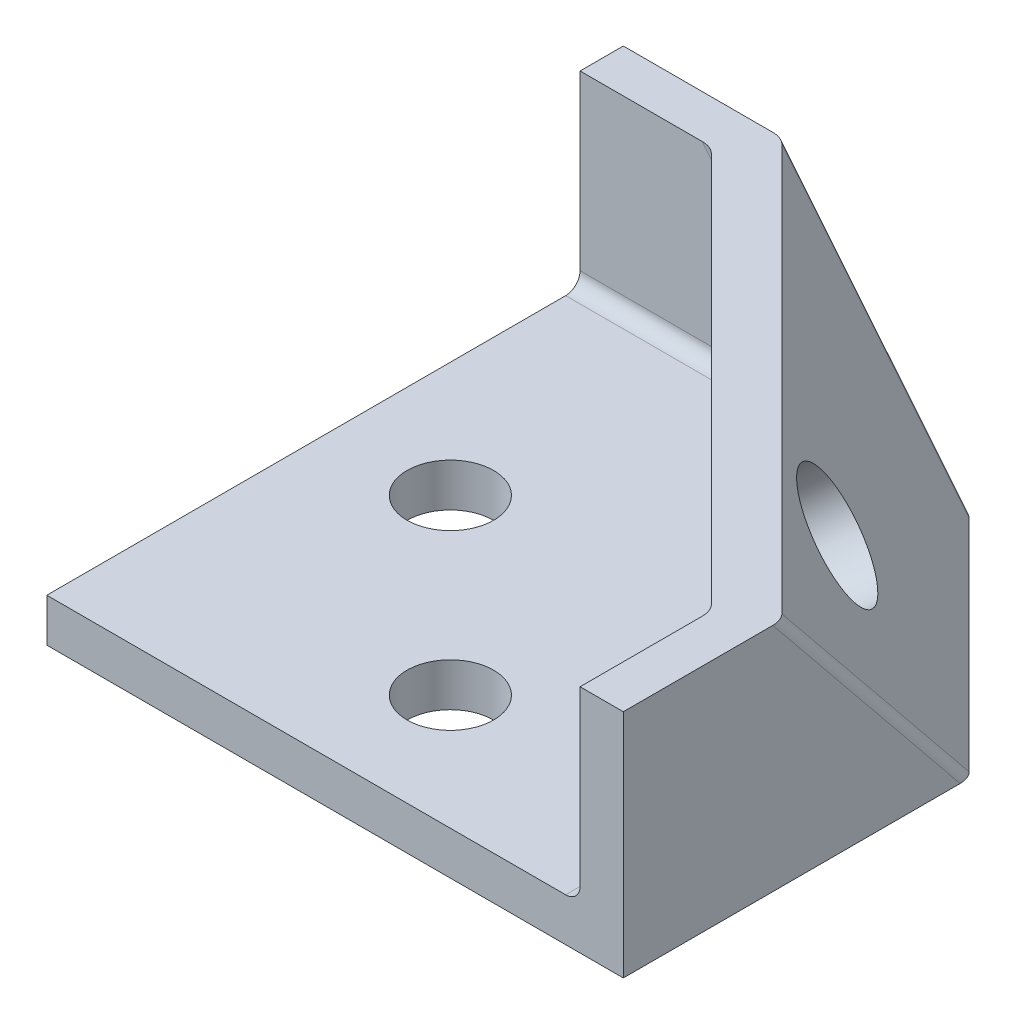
ISO-10303-21;
HEADER;
FILE_DESCRIPTION(('STEP AP214'),'2;1');
FILE_NAME('part.step','',(''),(''),'','','');
FILE_SCHEMA(('AUTOMOTIVE_DESIGN { 1 0 10303 214 1 1 1 1 }'));
ENDSEC;
DATA;
#1=APPLICATION_CONTEXT('core data for automotive mechanical design processes');
#2=APPLICATION_PROTOCOL_DEFINITION('international standard','automotive_design',2000,#1);
#3=PRODUCT_CONTEXT('',#1,'mechanical');
#4=PRODUCT('Part','Part','',(#3));
#5=PRODUCT_RELATED_PRODUCT_CATEGORY('part','',(#4));
#6=PRODUCT_DEFINITION_FORMATION('','',#4);
#7=PRODUCT_DEFINITION_CONTEXT('part definition',#1,'design');
#8=PRODUCT_DEFINITION('design','',#6,#7);
#9=PRODUCT_DEFINITION_SHAPE('','',#8);
#10=(LENGTH_UNIT() NAMED_UNIT(*) SI_UNIT(.MILLI.,.METRE.));
#11=(NAMED_UNIT(*) PLANE_ANGLE_UNIT() SI_UNIT($,.RADIAN.));
#12=(NAMED_UNIT(*) SI_UNIT($,.STERADIAN.) SOLID_ANGLE_UNIT());
#13=UNCERTAINTY_MEASURE_WITH_UNIT(LENGTH_MEASURE(1.E-05),#10,'distance_accuracy_value','');
#14=(GEOMETRIC_REPRESENTATION_CONTEXT(3) GLOBAL_UNCERTAINTY_ASSIGNED_CONTEXT((#13)) GLOBAL_UNIT_ASSIGNED_CONTEXT((#10,
#11,#12)) REPRESENTATION_CONTEXT('',''));
#15=CARTESIAN_POINT('',(0.,0.,0.));
#16=DIRECTION('',(0.,0.,1.));
#17=DIRECTION('',(1.,0.,0.));
#18=AXIS2_PLACEMENT_3D('',#15,#16,#17);
#19=CARTESIAN_POINT('',(-63.5,50.8,-63.5));
#20=DIRECTION('',(1.,0.,0.));
#21=DIRECTION('',(0.,0.,-1.));
#22=AXIS2_PLACEMENT_3D('',#19,#20,#21);
#23=PLANE('',#22);
#24=DIRECTION('',(0.,0.,1.));
#25=VECTOR('',#24,1.);
#26=CARTESIAN_POINT('',(-63.5,9.525,-63.5));
#27=LINE('',#26,#25);
#28=CARTESIAN_POINT('',(-63.5,9.525,-50.8));
#29=VERTEX_POINT('',#28);
#30=CARTESIAN_POINT('',(-63.5,9.525,63.5));
#31=VERTEX_POINT('',#30);
#32=EDGE_CURVE('E318',#29,#31,#27,.T.);
#33=ORIENTED_EDGE('',*,*,#32,.F.);
#34=CARTESIAN_POINT('',(-63.5,12.7,-50.8));
#35=DIRECTION('',(1.,0.,0.));
#36=DIRECTION('',(0.,0.,-1.));
#37=AXIS2_PLACEMENT_3D('',#34,#35,#36);
#38=CIRCLE('',#37,3.175);
#39=CARTESIAN_POINT('',(-63.5,12.7,-53.975));
#40=VERTEX_POINT('',#39);
#41=EDGE_CURVE('E178',#29,#40,#38,.T.);
#42=ORIENTED_EDGE('',*,*,#41,.T.);
#43=DIRECTION('',(0.,-1.,0.));
#44=VECTOR('',#43,1.);
#45=CARTESIAN_POINT('',(-63.5,50.8,-53.975));
#46=LINE('',#45,#44);
#47=CARTESIAN_POINT('',(-63.5,50.8,-53.975));
#48=VERTEX_POINT('',#47);
#49=EDGE_CURVE('E163',#48,#40,#46,.T.);
#50=ORIENTED_EDGE('',*,*,#49,.F.);
#51=DIRECTION('',(0.,0.,1.));
#52=VECTOR('',#51,1.);
#53=CARTESIAN_POINT('',(-63.5,50.8,-63.5));
#54=LINE('',#53,#52);
#55=CARTESIAN_POINT('',(-63.5,50.8,-63.5));
#56=VERTEX_POINT('',#55);
#57=EDGE_CURVE('E176',#56,#48,#54,.T.);
#58=ORIENTED_EDGE('',*,*,#57,.F.);
#59=DIRECTION('',(0.,-1.,0.));
#60=VECTOR('',#59,1.);
#61=CARTESIAN_POINT('',(-63.5,50.8,-63.5));
#62=LINE('',#61,#60);
#63=CARTESIAN_POINT('',(-63.5,0.,-63.5));
#64=VERTEX_POINT('',#63);
#65=EDGE_CURVE('E197',#56,#64,#62,.T.);
#66=ORIENTED_EDGE('',*,*,#65,.T.);
#67=DIRECTION('',(0.,0.,1.));
#68=VECTOR('',#67,1.);
#69=CARTESIAN_POINT('',(-63.5,0.,-63.5));
#70=LINE('',#69,#68);
#71=CARTESIAN_POINT('',(-63.5,0.,63.5));
#72=VERTEX_POINT('',#71);
#73=EDGE_CURVE('E325',#64,#72,#70,.T.);
#74=ORIENTED_EDGE('',*,*,#73,.T.);
#75=DIRECTION('',(0.,-1.,0.));
#76=VECTOR('',#75,1.);
#77=CARTESIAN_POINT('',(-63.5,50.8,63.5));
#78=LINE('',#77,#76);
#79=EDGE_CURVE('E202',#31,#72,#78,.T.);
#80=ORIENTED_EDGE('',*,*,#79,.F.);
#81=EDGE_LOOP('',(#33,#42,#50,#58,#66,#74,#80));
#82=FACE_BOUND('',#81,.T.);
#83=ADVANCED_FACE('F52',(#82),#23,.F.);
#84=CARTESIAN_POINT('',(-63.5,50.8,63.5));
#85=DIRECTION('',(0.,0.,-1.));
#86=DIRECTION('',(-1.,0.,0.));
#87=AXIS2_PLACEMENT_3D('',#84,#85,#86);
#88=PLANE('',#87);
#89=DIRECTION('',(1.,0.,0.));
#90=VECTOR('',#89,1.);
#91=CARTESIAN_POINT('',(-63.5,9.525,63.5));
#92=LINE('',#91,#90);
#93=CARTESIAN_POINT('',(50.8,9.525,63.5));
#94=VERTEX_POINT('',#93);
#95=EDGE_CURVE('E264',#31,#94,#92,.T.);
#96=ORIENTED_EDGE('',*,*,#95,.F.);
#97=ORIENTED_EDGE('',*,*,#79,.T.);
#98=DIRECTION('',(1.,0.,0.));
#99=VECTOR('',#98,1.);
#100=CARTESIAN_POINT('',(-63.5,0.,63.5));
#101=LINE('',#100,#99);
#102=CARTESIAN_POINT('',(63.5,0.,63.5));
#103=VERTEX_POINT('',#102);
#104=EDGE_CURVE('E328',#72,#103,#101,.T.);
#105=ORIENTED_EDGE('',*,*,#104,.T.);
#106=DIRECTION('',(0.,-1.,0.));
#107=VECTOR('',#106,1.);
#108=CARTESIAN_POINT('',(63.5,50.8,63.5));
#109=LINE('',#108,#107);
#110=CARTESIAN_POINT('',(63.5,50.8,63.5));
#111=VERTEX_POINT('',#110);
#112=EDGE_CURVE('E199',#111,#103,#109,.T.);
#113=ORIENTED_EDGE('',*,*,#112,.F.);
#114=DIRECTION('',(1.,0.,0.));
#115=VECTOR('',#114,1.);
#116=CARTESIAN_POINT('',(-63.5,50.8,63.5));
#117=LINE('',#116,#115);
#118=CARTESIAN_POINT('',(53.975,50.8,63.5));
#119=VERTEX_POINT('',#118);
#120=EDGE_CURVE('E185',#119,#111,#117,.T.);
#121=ORIENTED_EDGE('',*,*,#120,.F.);
#122=DIRECTION('',(0.,-1.,0.));
#123=VECTOR('',#122,1.);
#124=CARTESIAN_POINT('',(53.975,50.8,63.5));
#125=LINE('',#124,#123);
#126=CARTESIAN_POINT('',(53.975,12.7,63.5));
#127=VERTEX_POINT('',#126);
#128=EDGE_CURVE('E179',#119,#127,#125,.T.);
#129=ORIENTED_EDGE('',*,*,#128,.T.);
#130=CARTESIAN_POINT('',(50.8,12.7,63.5));
#131=DIRECTION('',(0.,0.,-1.));
#132=DIRECTION('',(-1.,0.,0.));
#133=AXIS2_PLACEMENT_3D('',#130,#131,#132);
#134=CIRCLE('',#133,3.175);
#135=EDGE_CURVE('E217',#127,#94,#134,.T.);
#136=ORIENTED_EDGE('',*,*,#135,.T.);
#137=EDGE_LOOP('',(#96,#97,#105,#113,#121,#129,#136));
#138=FACE_BOUND('',#137,.T.);
#139=ADVANCED_FACE('F351',(#138),#88,.F.);
#140=CARTESIAN_POINT('',(63.5,50.8,-63.5));
#141=DIRECTION('',(-1.,0.,0.));
#142=DIRECTION('',(0.,0.,1.));
#143=AXIS2_PLACEMENT_3D('',#140,#141,#142);
#144=PLANE('',#143);
#145=DIRECTION('',(0.,0.,-1.));
#146=VECTOR('',#145,1.);
#147=CARTESIAN_POINT('',(63.5,0.,-63.5));
#148=LINE('',#147,#146);
#149=CARTESIAN_POINT('',(63.5,0.,-10.696579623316));
#150=VERTEX_POINT('',#149);
#151=EDGE_CURVE('E190',#103,#150,#148,.T.);
#152=ORIENTED_EDGE('',*,*,#151,.T.);
#153=DIRECTION('',(0.,-0.776114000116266,-0.630592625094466));
#154=VECTOR('',#153,1.);
#155=CARTESIAN_POINT('',(63.5,49.8195024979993,29.7817661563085));
#156=LINE('',#155,#154);
#157=CARTESIAN_POINT('',(63.5,50.8,30.578420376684));
#158=VERTEX_POINT('',#157);
#159=EDGE_CURVE('E249',#150,#158,#156,.F.);
#160=ORIENTED_EDGE('',*,*,#159,.T.);
#161=DIRECTION('',(0.,0.,-1.));
#162=VECTOR('',#161,1.);
#163=CARTESIAN_POINT('',(63.5,50.8,-63.5));
#164=LINE('',#163,#162);
#165=EDGE_CURVE('E188',#111,#158,#164,.T.);
#166=ORIENTED_EDGE('',*,*,#165,.F.);
#167=ORIENTED_EDGE('',*,*,#112,.T.);
#168=EDGE_LOOP('',(#152,#160,#166,#167));
#169=FACE_BOUND('',#168,.T.);
#170=ADVANCED_FACE('F331',(#169),#144,.F.);
#171=CARTESIAN_POINT('',(-63.5,50.8,-63.5));
#172=DIRECTION('',(0.,0.,1.));
#173=DIRECTION('',(1.,0.,0.));
#174=AXIS2_PLACEMENT_3D('',#171,#172,#173);
#175=PLANE('',#174);
#176=DIRECTION('',(-1.,0.,0.));
#177=VECTOR('',#176,1.);
#178=CARTESIAN_POINT('',(-63.5,50.8,-63.5));
#179=LINE('',#178,#177);
#180=CARTESIAN_POINT('',(-30.5784203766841,50.8,-63.5));
#181=VERTEX_POINT('',#180);
#182=EDGE_CURVE('E183',#181,#56,#179,.T.);
#183=ORIENTED_EDGE('',*,*,#182,.F.);
#184=DIRECTION('',(-0.630592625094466,0.776114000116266,0.));
#185=VECTOR('',#184,1.);
#186=CARTESIAN_POINT('',(11.4932338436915,-0.980497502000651,-63.5));
#187=LINE('',#186,#185);
#188=CARTESIAN_POINT('',(10.696579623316,0.,-63.5));
#189=VERTEX_POINT('',#188);
#190=EDGE_CURVE('E74',#181,#189,#187,.F.);
#191=ORIENTED_EDGE('',*,*,#190,.T.);
#192=DIRECTION('',(-1.,0.,0.));
#193=VECTOR('',#192,1.);
#194=CARTESIAN_POINT('',(-63.5,0.,-63.5));
#195=LINE('',#194,#193);
#196=EDGE_CURVE('E186',#189,#64,#195,.T.);
#197=ORIENTED_EDGE('',*,*,#196,.T.);
#198=ORIENTED_EDGE('',*,*,#65,.F.);
#199=EDGE_LOOP('',(#183,#191,#197,#198));
#200=FACE_BOUND('',#199,.T.);
#201=ADVANCED_FACE('F346',(#200),#175,.F.);
#202=CARTESIAN_POINT('',(-63.5,50.8,63.5));
#203=DIRECTION('',(0.,1.,0.));
#204=DIRECTION('',(0.,0.,1.));
#205=AXIS2_PLACEMENT_3D('',#202,#203,#204);
#206=PLANE('',#205);
#207=DIRECTION('',(-0.707106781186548,0.,-0.707106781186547));
#208=VECTOR('',#207,1.);
#209=CARTESIAN_POINT('',(17.4625,50.8,-17.4625));
#210=LINE('',#209,#208);
#211=CARTESIAN_POINT('',(62.2716602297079,50.8,27.346660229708));
#212=VERTEX_POINT('',#211);
#213=CARTESIAN_POINT('',(-27.346660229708,50.8,-62.2716602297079));
#214=VERTEX_POINT('',#213);
#215=EDGE_CURVE('E323',#212,#214,#210,.T.);
#216=ORIENTED_EDGE('',*,*,#215,.T.);
#217=CARTESIAN_POINT('',(-30.5784203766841,50.8,-60.325));
#218=DIRECTION('',(0.,1.,0.));
#219=DIRECTION('',(1.,0.,0.));
#220=AXIS2_PLACEMENT_3D('',#217,#218,#219);
#221=ELLIPSE('',#220,4.09089386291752,3.175);
#222=EDGE_CURVE('E243',#214,#181,#221,.T.);
#223=ORIENTED_EDGE('',*,*,#222,.T.);
#224=ORIENTED_EDGE('',*,*,#182,.T.);
#225=ORIENTED_EDGE('',*,*,#57,.T.);
#226=DIRECTION('',(-1.,0.,0.));
#227=VECTOR('',#226,1.);
#228=CARTESIAN_POINT('',(-63.5,50.8,-53.975));
#229=LINE('',#228,#227);
#230=CARTESIAN_POINT('',(-36.5886815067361,50.8,-53.975));
#231=VERTEX_POINT('',#230);
#232=EDGE_CURVE('E159',#231,#48,#229,.T.);
#233=ORIENTED_EDGE('',*,*,#232,.F.);
#234=CARTESIAN_POINT('',(-36.5886815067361,50.8,-50.8));
#235=DIRECTION('',(0.,1.,0.));
#236=DIRECTION('',(-1.,0.,0.));
#237=AXIS2_PLACEMENT_3D('',#234,#235,#236);
#238=ELLIPSE('',#237,4.09089386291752,3.175);
#239=CARTESIAN_POINT('',(-33.35692135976,50.8,-52.7466602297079));
#240=VERTEX_POINT('',#239);
#241=EDGE_CURVE('E36',#231,#240,#238,.F.);
#242=ORIENTED_EDGE('',*,*,#241,.T.);
#243=DIRECTION('',(-0.707106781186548,0.,-0.707106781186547));
#244=VECTOR('',#243,1.);
#245=CARTESIAN_POINT('',(9.69486943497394,50.8,-9.69486943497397));
#246=LINE('',#245,#244);
#247=CARTESIAN_POINT('',(52.7466602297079,50.8,33.35692135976));
#248=VERTEX_POINT('',#247);
#249=EDGE_CURVE('E256',#248,#240,#246,.T.);
#250=ORIENTED_EDGE('',*,*,#249,.F.);
#251=CARTESIAN_POINT('',(50.8,50.8,36.5886815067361));
#252=DIRECTION('',(0.,1.,0.));
#253=DIRECTION('',(0.,0.,-1.));
#254=AXIS2_PLACEMENT_3D('',#251,#252,#253);
#255=ELLIPSE('',#254,4.09089386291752,3.175);
#256=CARTESIAN_POINT('',(53.975,50.8,36.5886815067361));
#257=VERTEX_POINT('',#256);
#258=EDGE_CURVE('E59',#248,#257,#255,.F.);
#259=ORIENTED_EDGE('',*,*,#258,.T.);
#260=DIRECTION('',(0.,0.,-1.));
#261=VECTOR('',#260,1.);
#262=CARTESIAN_POINT('',(53.975,50.8,-63.5));
#263=LINE('',#262,#261);
#264=EDGE_CURVE('E170',#119,#257,#263,.T.);
#265=ORIENTED_EDGE('',*,*,#264,.F.);
#266=ORIENTED_EDGE('',*,*,#120,.T.);
#267=ORIENTED_EDGE('',*,*,#165,.T.);
#268=CARTESIAN_POINT('',(60.325,50.8,30.578420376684));
#269=DIRECTION('',(0.,1.,0.));
#270=DIRECTION('',(0.,0.,1.));
#271=AXIS2_PLACEMENT_3D('',#268,#269,#270);
#272=ELLIPSE('',#271,4.09089386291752,3.175);
#273=EDGE_CURVE('E241',#158,#212,#272,.T.);
#274=ORIENTED_EDGE('',*,*,#273,.T.);
#275=EDGE_LOOP('',(#216,#223,#224,#225,#233,#242,#250,#259,#265,#266,#267,#274));
#276=FACE_BOUND('',#275,.T.);
#277=ADVANCED_FACE('F182',(#276),#206,.T.);
#278=CARTESIAN_POINT('',(-63.5,0.,63.5));
#279=DIRECTION('',(0.,1.,0.));
#280=DIRECTION('',(0.,0.,1.));
#281=AXIS2_PLACEMENT_3D('',#278,#279,#280);
#282=PLANE('',#281);
#283=CARTESIAN_POINT('',(0.,0.,38.1));
#284=DIRECTION('',(0.,1.,0.));
#285=DIRECTION('',(0.,0.,1.));
#286=AXIS2_PLACEMENT_3D('',#283,#284,#285);
#287=CIRCLE('',#286,9.525);
#288=CARTESIAN_POINT('',(0.,0.,47.625));
#289=VERTEX_POINT('',#288);
#290=EDGE_CURVE('E303',#289,#289,#287,.T.);
#291=ORIENTED_EDGE('',*,*,#290,.T.);
#292=EDGE_LOOP('',(#291));
#293=FACE_BOUND('',#292,.T.);
#294=CARTESIAN_POINT('',(-38.1,0.,0.));
#295=DIRECTION('',(0.,1.,0.));
#296=DIRECTION('',(0.,0.,1.));
#297=AXIS2_PLACEMENT_3D('',#294,#295,#296);
#298=CIRCLE('',#297,9.525);
#299=CARTESIAN_POINT('',(-38.1,0.,9.525));
#300=VERTEX_POINT('',#299);
#301=EDGE_CURVE('E309',#300,#300,#298,.T.);
#302=ORIENTED_EDGE('',*,*,#301,.T.);
#303=EDGE_LOOP('',(#302));
#304=FACE_BOUND('',#303,.T.);
#305=ORIENTED_EDGE('',*,*,#196,.F.);
#306=CARTESIAN_POINT('',(10.696579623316,0.,-60.325));
#307=DIRECTION('',(0.,1.,0.));
#308=DIRECTION('',(1.,0.,0.));
#309=AXIS2_PLACEMENT_3D('',#306,#307,#308);
#310=ELLIPSE('',#309,4.09089386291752,3.175);
#311=CARTESIAN_POINT('',(13.928339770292,0.,-62.2716602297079));
#312=VERTEX_POINT('',#311);
#313=EDGE_CURVE('E247',#189,#312,#310,.F.);
#314=ORIENTED_EDGE('',*,*,#313,.T.);
#315=DIRECTION('',(-0.707106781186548,0.,-0.707106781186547));
#316=VECTOR('',#315,1.);
#317=CARTESIAN_POINT('',(38.1,0.,-38.1));
#318=LINE('',#317,#316);
#319=CARTESIAN_POINT('',(62.2716602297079,0.,-13.9283397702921));
#320=VERTEX_POINT('',#319);
#321=EDGE_CURVE('E204',#320,#312,#318,.T.);
#322=ORIENTED_EDGE('',*,*,#321,.F.);
#323=CARTESIAN_POINT('',(60.325,0.,-10.696579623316));
#324=DIRECTION('',(0.,1.,0.));
#325=DIRECTION('',(0.,0.,1.));
#326=AXIS2_PLACEMENT_3D('',#323,#324,#325);
#327=ELLIPSE('',#326,4.09089386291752,3.175);
#328=EDGE_CURVE('E66',#320,#150,#327,.F.);
#329=ORIENTED_EDGE('',*,*,#328,.T.);
#330=ORIENTED_EDGE('',*,*,#151,.F.);
#331=ORIENTED_EDGE('',*,*,#104,.F.);
#332=ORIENTED_EDGE('',*,*,#73,.F.);
#333=EDGE_LOOP('',(#305,#314,#322,#329,#330,#331,#332));
#334=FACE_BOUND('',#333,.T.);
#335=ADVANCED_FACE('F349',(#293,#304,#334),#282,.F.);
#336=CARTESIAN_POINT('',(28.6449339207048,23.2740088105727,-28.6449339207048));
#337=DIRECTION('',(0.613121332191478,0.498161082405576,-0.613121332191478));
#338=DIRECTION('',(-0.707106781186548,0.,-0.707106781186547));
#339=AXIS2_PLACEMENT_3D('',#336,#337,#338);
#340=PLANE('',#339);
#341=CARTESIAN_POINT('',(38.4178570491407,35.7889128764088,-8.70365123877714));
#342=DIRECTION('',(0.613121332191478,0.498161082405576,-0.613121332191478));
#343=DIRECTION('',(-0.707106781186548,0.,-0.707106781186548));
#344=AXIS2_PLACEMENT_3D('',#341,#342,#343);
#345=CIRCLE('',#344,12.7);
#346=CARTESIAN_POINT('',(29.4376009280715,35.7889128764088,-17.6839073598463));
#347=VERTEX_POINT('',#346);
#348=EDGE_CURVE('E312',#347,#347,#345,.T.);
#349=ORIENTED_EDGE('',*,*,#348,.F.);
#350=EDGE_LOOP('',(#349));
#351=FACE_BOUND('',#350,.T.);
#352=ORIENTED_EDGE('',*,*,#321,.T.);
#353=DIRECTION('',(-0.630592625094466,0.776114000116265,0.));
#354=VECTOR('',#353,1.);
#355=CARTESIAN_POINT('',(-27.8351059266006,51.401163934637,-62.2716602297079));
#356=LINE('',#355,#354);
#357=EDGE_CURVE('E238',#312,#214,#356,.T.);
#358=ORIENTED_EDGE('',*,*,#357,.T.);
#359=ORIENTED_EDGE('',*,*,#215,.F.);
#360=DIRECTION('',(0.,-0.776114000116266,-0.630592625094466));
#361=VECTOR('',#360,1.);
#362=CARTESIAN_POINT('',(62.2716602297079,0.601163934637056,-13.4398940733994));
#363=LINE('',#362,#361);
#364=EDGE_CURVE('E235',#212,#320,#363,.T.);
#365=ORIENTED_EDGE('',*,*,#364,.T.);
#366=EDGE_LOOP('',(#352,#358,#359,#365));
#367=FACE_BOUND('',#366,.T.);
#368=ADVANCED_FACE('F341',(#351,#367),#340,.T.);
#369=CARTESIAN_POINT('',(53.975,50.8,-63.5));
#370=DIRECTION('',(-1.,0.,0.));
#371=DIRECTION('',(0.,0.,1.));
#372=AXIS2_PLACEMENT_3D('',#369,#370,#371);
#373=PLANE('',#372);
#374=ORIENTED_EDGE('',*,*,#264,.T.);
#375=DIRECTION('',(0.,-0.776114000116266,-0.630592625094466));
#376=VECTOR('',#375,1.);
#377=CARTESIAN_POINT('',(53.975,1.81542175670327,-3.21128831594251));
#378=LINE('',#377,#376);
#379=CARTESIAN_POINT('',(53.975,12.7,5.63243150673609));
#380=VERTEX_POINT('',#379);
#381=EDGE_CURVE('E219',#257,#380,#378,.T.);
#382=ORIENTED_EDGE('',*,*,#381,.T.);
#383=DIRECTION('',(0.,0.,-1.));
#384=VECTOR('',#383,1.);
#385=CARTESIAN_POINT('',(53.975,12.7,63.5));
#386=LINE('',#385,#384);
#387=EDGE_CURVE('E214',#380,#127,#386,.F.);
#388=ORIENTED_EDGE('',*,*,#387,.T.);
#389=ORIENTED_EDGE('',*,*,#128,.F.);
#390=EDGE_LOOP('',(#374,#382,#388,#389));
#391=FACE_BOUND('',#390,.T.);
#392=ADVANCED_FACE('F261',(#391),#373,.T.);
#393=CARTESIAN_POINT('',(-63.5,50.8,-53.975));
#394=DIRECTION('',(0.,0.,1.));
#395=DIRECTION('',(1.,0.,0.));
#396=AXIS2_PLACEMENT_3D('',#393,#394,#395);
#397=PLANE('',#396);
#398=DIRECTION('',(-1.,0.,0.));
#399=VECTOR('',#398,1.);
#400=CARTESIAN_POINT('',(-1.04932363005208,12.7,-53.975));
#401=LINE('',#400,#399);
#402=CARTESIAN_POINT('',(-5.6324315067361,12.7,-53.975));
#403=VERTEX_POINT('',#402);
#404=EDGE_CURVE('E212',#40,#403,#401,.F.);
#405=ORIENTED_EDGE('',*,*,#404,.T.);
#406=DIRECTION('',(-0.630592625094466,0.776114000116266,0.));
#407=VECTOR('',#406,1.);
#408=CARTESIAN_POINT('',(-47.2898881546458,63.9707158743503,-53.975));
#409=LINE('',#408,#407);
#410=EDGE_CURVE('E166',#403,#231,#409,.T.);
#411=ORIENTED_EDGE('',*,*,#410,.T.);
#412=ORIENTED_EDGE('',*,*,#232,.T.);
#413=ORIENTED_EDGE('',*,*,#49,.T.);
#414=EDGE_LOOP('',(#405,#411,#412,#413));
#415=FACE_BOUND('',#414,.T.);
#416=ADVANCED_FACE('F162',(#415),#397,.T.);
#417=CARTESIAN_POINT('',(-63.5,9.525,63.5));
#418=DIRECTION('',(0.,1.,0.));
#419=DIRECTION('',(0.,0.,1.));
#420=AXIS2_PLACEMENT_3D('',#417,#418,#419);
#421=PLANE('',#420);
#422=CARTESIAN_POINT('',(0.,9.525,38.1));
#423=DIRECTION('',(0.,1.,0.));
#424=DIRECTION('',(0.,0.,1.));
#425=AXIS2_PLACEMENT_3D('',#422,#423,#424);
#426=CIRCLE('',#425,9.525);
#427=CARTESIAN_POINT('',(0.,9.525,47.625));
#428=VERTEX_POINT('',#427);
#429=EDGE_CURVE('E297',#428,#428,#426,.T.);
#430=ORIENTED_EDGE('',*,*,#429,.F.);
#431=EDGE_LOOP('',(#430));
#432=FACE_BOUND('',#431,.T.);
#433=CARTESIAN_POINT('',(-38.1,9.525,0.));
#434=DIRECTION('',(0.,1.,0.));
#435=DIRECTION('',(0.,0.,1.));
#436=AXIS2_PLACEMENT_3D('',#433,#434,#435);
#437=CIRCLE('',#436,9.525);
#438=CARTESIAN_POINT('',(-38.1,9.525,9.525));
#439=VERTEX_POINT('',#438);
#440=EDGE_CURVE('E306',#439,#439,#437,.T.);
#441=ORIENTED_EDGE('',*,*,#440,.F.);
#442=EDGE_LOOP('',(#441));
#443=FACE_BOUND('',#442,.T.);
#444=DIRECTION('',(0.,0.,-1.));
#445=VECTOR('',#444,1.);
#446=CARTESIAN_POINT('',(50.8,9.525,1.04932363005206));
#447=LINE('',#446,#445);
#448=CARTESIAN_POINT('',(50.8,9.525,5.63243150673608));
#449=VERTEX_POINT('',#448);
#450=EDGE_CURVE('E207',#94,#449,#447,.T.);
#451=ORIENTED_EDGE('',*,*,#450,.T.);
#452=DIRECTION('',(-0.707106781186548,0.,-0.707106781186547));
#453=VECTOR('',#452,1.);
#454=CARTESIAN_POINT('',(22.5837842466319,9.525,-22.583784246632));
#455=LINE('',#454,#453);
#456=CARTESIAN_POINT('',(-5.6324315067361,9.525,-50.8));
#457=VERTEX_POINT('',#456);
#458=EDGE_CURVE('E230',#449,#457,#455,.T.);
#459=ORIENTED_EDGE('',*,*,#458,.T.);
#460=DIRECTION('',(-1.,0.,0.));
#461=VECTOR('',#460,1.);
#462=CARTESIAN_POINT('',(-63.5,9.525,-50.8));
#463=LINE('',#462,#461);
#464=EDGE_CURVE('E210',#457,#29,#463,.T.);
#465=ORIENTED_EDGE('',*,*,#464,.T.);
#466=ORIENTED_EDGE('',*,*,#32,.T.);
#467=ORIENTED_EDGE('',*,*,#95,.T.);
#468=EDGE_LOOP('',(#451,#459,#465,#466,#467));
#469=FACE_BOUND('',#468,.T.);
#470=ADVANCED_FACE('F283',(#432,#443,#469),#421,.T.);
#471=CARTESIAN_POINT('',(22.804953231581,18.5290245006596,-22.804953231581));
#472=DIRECTION('',(0.613121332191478,0.498161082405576,-0.613121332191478));
#473=DIRECTION('',(-0.707106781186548,0.,-0.707106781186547));
#474=AXIS2_PLACEMENT_3D('',#471,#472,#473);
#475=PLANE('',#474);
#476=CARTESIAN_POINT('',(32.5778763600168,31.0439285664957,-2.86367054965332));
#477=DIRECTION('',(0.613121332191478,0.498161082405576,-0.613121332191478));
#478=DIRECTION('',(-0.707106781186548,0.,-0.707106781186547));
#479=AXIS2_PLACEMENT_3D('',#476,#477,#478);
#480=CIRCLE('',#479,12.7);
#481=CARTESIAN_POINT('',(23.5976202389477,31.0439285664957,-11.8439266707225));
#482=VERTEX_POINT('',#481);
#483=EDGE_CURVE('E315',#482,#482,#480,.F.);
#484=ORIENTED_EDGE('',*,*,#483,.F.);
#485=EDGE_LOOP('',(#484));
#486=FACE_BOUND('',#485,.T.);
#487=DIRECTION('',(-0.707106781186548,0.,-0.707106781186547));
#488=VECTOR('',#487,1.);
#489=CARTESIAN_POINT('',(24.5304444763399,14.2816614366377,-24.5304444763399));
#490=LINE('',#489,#488);
#491=CARTESIAN_POINT('',(-3.68577127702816,14.2816614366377,-52.7466602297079));
#492=VERTEX_POINT('',#491);
#493=CARTESIAN_POINT('',(52.7466602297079,14.2816614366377,3.68577127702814));
#494=VERTEX_POINT('',#493);
#495=EDGE_CURVE('E224',#492,#494,#490,.F.);
#496=ORIENTED_EDGE('',*,*,#495,.T.);
#497=DIRECTION('',(0.,-0.776114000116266,-0.630592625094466));
#498=VECTOR('',#497,1.);
#499=CARTESIAN_POINT('',(52.7466602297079,3.87520084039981,-4.76947795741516));
#500=LINE('',#499,#498);
#501=EDGE_CURVE('E226',#494,#248,#500,.F.);
#502=ORIENTED_EDGE('',*,*,#501,.T.);
#503=ORIENTED_EDGE('',*,*,#249,.T.);
#504=DIRECTION('',(-0.630592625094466,0.776114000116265,0.));
#505=VECTOR('',#504,1.);
#506=CARTESIAN_POINT('',(4.76947795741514,3.8752008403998,-52.7466602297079));
#507=LINE('',#506,#505);
#508=EDGE_CURVE('E222',#240,#492,#507,.F.);
#509=ORIENTED_EDGE('',*,*,#508,.T.);
#510=EDGE_LOOP('',(#496,#502,#503,#509));
#511=FACE_BOUND('',#510,.T.);
#512=ADVANCED_FACE('F387',(#486,#511),#475,.F.);
#513=CARTESIAN_POINT('',(-37.9696906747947,-26.2759696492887,67.6838964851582));
#514=DIRECTION('',(0.613121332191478,0.498161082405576,-0.613121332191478));
#515=DIRECTION('',(-0.707106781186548,0.,-0.707106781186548));
#516=AXIS2_PLACEMENT_3D('',#513,#514,#515);
#517=CYLINDRICAL_SURFACE('',#516,12.7);
#518=ORIENTED_EDGE('',*,*,#348,.T.);
#519=EDGE_LOOP('',(#518));
#520=FACE_BOUND('',#519,.T.);
#521=ORIENTED_EDGE('',*,*,#483,.T.);
#522=EDGE_LOOP('',(#521));
#523=FACE_BOUND('',#522,.T.);
#524=ADVANCED_FACE('F390',(#520,#523),#517,.F.);
#525=CARTESIAN_POINT('',(-38.1,0.,0.));
#526=DIRECTION('',(0.,1.,0.));
#527=DIRECTION('',(0.,0.,1.));
#528=AXIS2_PLACEMENT_3D('',#525,#526,#527);
#529=CYLINDRICAL_SURFACE('',#528,9.525);
#530=CARTESIAN_POINT('',(-38.1,0.,9.525));
#531=CARTESIAN_POINT('',(-38.1,0.0992187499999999,9.525));
#532=CARTESIAN_POINT('',(-38.1,0.1984375,9.525));
#533=CARTESIAN_POINT('',(-38.1,0.396875,9.525));
#534=CARTESIAN_POINT('',(-38.1,0.49609375,9.525));
#535=CARTESIAN_POINT('',(-38.1,0.69453125,9.525));
#536=CARTESIAN_POINT('',(-38.1,0.79375,9.525));
#537=CARTESIAN_POINT('',(-38.1,0.9921875,9.525));
#538=CARTESIAN_POINT('',(-38.1,1.09140625,9.525));
#539=CARTESIAN_POINT('',(-38.1,1.28984375,9.525));
#540=CARTESIAN_POINT('',(-38.1,1.3890625,9.525));
#541=CARTESIAN_POINT('',(-38.1,1.5875,9.525));
#542=CARTESIAN_POINT('',(-38.1,1.68671875,9.525));
#543=CARTESIAN_POINT('',(-38.1,1.88515625,9.525));
#544=CARTESIAN_POINT('',(-38.1,1.984375,9.525));
#545=CARTESIAN_POINT('',(-38.1,2.1828125,9.525));
#546=CARTESIAN_POINT('',(-38.1,2.28203125,9.525));
#547=CARTESIAN_POINT('',(-38.1,2.48046875,9.525));
#548=CARTESIAN_POINT('',(-38.1,2.5796875,9.525));
#549=CARTESIAN_POINT('',(-38.1,2.778125,9.525));
#550=CARTESIAN_POINT('',(-38.1,2.87734375,9.525));
#551=CARTESIAN_POINT('',(-38.1,3.07578125,9.525));
#552=CARTESIAN_POINT('',(-38.1,3.175,9.525));
#553=CARTESIAN_POINT('',(-38.1,3.3734375,9.525));
#554=CARTESIAN_POINT('',(-38.1,3.47265625,9.525));
#555=CARTESIAN_POINT('',(-38.1,3.67109375,9.525));
#556=CARTESIAN_POINT('',(-38.1,3.7703125,9.525));
#557=CARTESIAN_POINT('',(-38.1,3.96875,9.525));
#558=CARTESIAN_POINT('',(-38.1,4.06796875,9.525));
#559=CARTESIAN_POINT('',(-38.1,4.26640625,9.525));
#560=CARTESIAN_POINT('',(-38.1,4.365625,9.525));
#561=CARTESIAN_POINT('',(-38.1,4.5640625,9.525));
#562=CARTESIAN_POINT('',(-38.1,4.66328125,9.525));
#563=CARTESIAN_POINT('',(-38.1,4.86171875,9.525));
#564=CARTESIAN_POINT('',(-38.1,4.9609375,9.525));
#565=CARTESIAN_POINT('',(-38.1,5.159375,9.525));
#566=CARTESIAN_POINT('',(-38.1,5.25859375,9.525));
#567=CARTESIAN_POINT('',(-38.1,5.45703125,9.525));
#568=CARTESIAN_POINT('',(-38.1,5.55625,9.525));
#569=CARTESIAN_POINT('',(-38.1,5.7546875,9.525));
#570=CARTESIAN_POINT('',(-38.1,5.85390625,9.525));
#571=CARTESIAN_POINT('',(-38.1,6.05234375,9.525));
#572=CARTESIAN_POINT('',(-38.1,6.1515625,9.525));
#573=CARTESIAN_POINT('',(-38.1,6.35,9.525));
#574=CARTESIAN_POINT('',(-38.1,6.44921875,9.525));
#575=CARTESIAN_POINT('',(-38.1,6.64765625,9.525));
#576=CARTESIAN_POINT('',(-38.1,6.746875,9.525));
#577=CARTESIAN_POINT('',(-38.1,6.9453125,9.525));
#578=CARTESIAN_POINT('',(-38.1,7.04453125,9.525));
#579=CARTESIAN_POINT('',(-38.1,7.24296875,9.525));
#580=CARTESIAN_POINT('',(-38.1,7.3421875,9.525));
#581=CARTESIAN_POINT('',(-38.1,7.540625,9.525));
#582=CARTESIAN_POINT('',(-38.1,7.63984375,9.525));
#583=CARTESIAN_POINT('',(-38.1,7.83828125,9.525));
#584=CARTESIAN_POINT('',(-38.1,7.9375,9.525));
#585=CARTESIAN_POINT('',(-38.1,8.1359375,9.525));
#586=CARTESIAN_POINT('',(-38.1,8.23515625,9.525));
#587=CARTESIAN_POINT('',(-38.1,8.43359375,9.525));
#588=CARTESIAN_POINT('',(-38.1,8.5328125,9.525));
#589=CARTESIAN_POINT('',(-38.1,8.73125,9.525));
#590=CARTESIAN_POINT('',(-38.1,8.83046875,9.525));
#591=CARTESIAN_POINT('',(-38.1,9.02890625,9.525));
#592=CARTESIAN_POINT('',(-38.1,9.128125,9.525));
#593=CARTESIAN_POINT('',(-38.1,9.3265625,9.525));
#594=CARTESIAN_POINT('',(-38.1,9.42578125,9.525));
#595=CARTESIAN_POINT('',(-38.1,9.525,9.525));
#596=B_SPLINE_CURVE_WITH_KNOTS('',3,(#530,#531,#532,#533,#534,#535,#536,#537,#538,#539,#540,
#541,#542,#543,#544,#545,#546,#547,#548,#549,#550,#551,#552,#553,#554,#555,#556,#557,#558,#559,
#560,#561,#562,#563,#564,#565,#566,#567,#568,#569,#570,#571,#572,#573,#574,#575,#576,#577,#578,
#579,#580,#581,#582,#583,#584,#585,#586,#587,#588,#589,#590,#591,#592,#593,#594,#595),
.UNSPECIFIED.,.F.,.F.,(4,2,2,2,2,2,2,2,2,2,2,2,2,2,2,2,2,2,2,2,2,2,2,2,2,2,2,2,2,2,2,2,4),(0.,
0.29765625,0.5953125,0.89296875,1.190625,1.48828125,1.7859375,2.08359375,2.38125,2.67890625,
2.9765625,3.27421875,3.571875,3.86953125,4.1671875,4.46484375,4.7625,5.06015625,5.3578125,
5.65546875,5.953125,6.25078125,6.5484375,6.84609375,7.14375,7.44140625,7.7390625,8.03671875,
8.334375,8.63203125,8.9296875,9.22734375,9.525),.UNSPECIFIED.);
#597=EDGE_CURVE('BSEAM401',#300,#439,#596,.T.);
#598=ORIENTED_EDGE('',*,*,#301,.F.);
#599=ORIENTED_EDGE('',*,*,#440,.T.);
#600=ORIENTED_EDGE('',*,*,#597,.T.);
#601=ORIENTED_EDGE('',*,*,#597,.F.);
#602=EDGE_LOOP('',(#598,#600,#599,#601));
#603=FACE_BOUND('',#602,.T.);
#604=ADVANCED_FACE('F401',(#603),#529,.F.);
#605=CARTESIAN_POINT('',(0.,0.,38.1));
#606=DIRECTION('',(0.,1.,0.));
#607=DIRECTION('',(0.,0.,1.));
#608=AXIS2_PLACEMENT_3D('',#605,#606,#607);
#609=CYLINDRICAL_SURFACE('',#608,9.525);
#610=CARTESIAN_POINT('',(0.,0.,47.625));
#611=CARTESIAN_POINT('',(0.,0.0992187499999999,47.625));
#612=CARTESIAN_POINT('',(0.,0.1984375,47.625));
#613=CARTESIAN_POINT('',(0.,0.396875,47.625));
#614=CARTESIAN_POINT('',(0.,0.49609375,47.625));
#615=CARTESIAN_POINT('',(0.,0.69453125,47.625));
#616=CARTESIAN_POINT('',(0.,0.79375,47.625));
#617=CARTESIAN_POINT('',(0.,0.9921875,47.625));
#618=CARTESIAN_POINT('',(0.,1.09140625,47.625));
#619=CARTESIAN_POINT('',(0.,1.28984375,47.625));
#620=CARTESIAN_POINT('',(0.,1.3890625,47.625));
#621=CARTESIAN_POINT('',(0.,1.5875,47.625));
#622=CARTESIAN_POINT('',(0.,1.68671875,47.625));
#623=CARTESIAN_POINT('',(0.,1.88515625,47.625));
#624=CARTESIAN_POINT('',(0.,1.984375,47.625));
#625=CARTESIAN_POINT('',(0.,2.1828125,47.625));
#626=CARTESIAN_POINT('',(0.,2.28203125,47.625));
#627=CARTESIAN_POINT('',(0.,2.48046875,47.625));
#628=CARTESIAN_POINT('',(0.,2.5796875,47.625));
#629=CARTESIAN_POINT('',(0.,2.778125,47.625));
#630=CARTESIAN_POINT('',(0.,2.87734375,47.625));
#631=CARTESIAN_POINT('',(0.,3.07578125,47.625));
#632=CARTESIAN_POINT('',(0.,3.175,47.625));
#633=CARTESIAN_POINT('',(0.,3.3734375,47.625));
#634=CARTESIAN_POINT('',(0.,3.47265625,47.625));
#635=CARTESIAN_POINT('',(0.,3.67109375,47.625));
#636=CARTESIAN_POINT('',(0.,3.7703125,47.625));
#637=CARTESIAN_POINT('',(0.,3.96875,47.625));
#638=CARTESIAN_POINT('',(0.,4.06796875,47.625));
#639=CARTESIAN_POINT('',(0.,4.26640625,47.625));
#640=CARTESIAN_POINT('',(0.,4.365625,47.625));
#641=CARTESIAN_POINT('',(0.,4.5640625,47.625));
#642=CARTESIAN_POINT('',(0.,4.66328125,47.625));
#643=CARTESIAN_POINT('',(0.,4.86171875,47.625));
#644=CARTESIAN_POINT('',(0.,4.9609375,47.625));
#645=CARTESIAN_POINT('',(0.,5.159375,47.625));
#646=CARTESIAN_POINT('',(0.,5.25859375,47.625));
#647=CARTESIAN_POINT('',(0.,5.45703125,47.625));
#648=CARTESIAN_POINT('',(0.,5.55625,47.625));
#649=CARTESIAN_POINT('',(0.,5.7546875,47.625));
#650=CARTESIAN_POINT('',(0.,5.85390625,47.625));
#651=CARTESIAN_POINT('',(0.,6.05234375,47.625));
#652=CARTESIAN_POINT('',(0.,6.1515625,47.625));
#653=CARTESIAN_POINT('',(0.,6.35,47.625));
#654=CARTESIAN_POINT('',(0.,6.44921875,47.625));
#655=CARTESIAN_POINT('',(0.,6.64765625,47.625));
#656=CARTESIAN_POINT('',(0.,6.746875,47.625));
#657=CARTESIAN_POINT('',(0.,6.9453125,47.625));
#658=CARTESIAN_POINT('',(0.,7.04453125,47.625));
#659=CARTESIAN_POINT('',(0.,7.24296875,47.625));
#660=CARTESIAN_POINT('',(0.,7.3421875,47.625));
#661=CARTESIAN_POINT('',(0.,7.540625,47.625));
#662=CARTESIAN_POINT('',(0.,7.63984375,47.625));
#663=CARTESIAN_POINT('',(0.,7.83828125,47.625));
#664=CARTESIAN_POINT('',(0.,7.9375,47.625));
#665=CARTESIAN_POINT('',(0.,8.1359375,47.625));
#666=CARTESIAN_POINT('',(0.,8.23515625,47.625));
#667=CARTESIAN_POINT('',(0.,8.43359375,47.625));
#668=CARTESIAN_POINT('',(0.,8.5328125,47.625));
#669=CARTESIAN_POINT('',(0.,8.73125,47.625));
#670=CARTESIAN_POINT('',(0.,8.83046875,47.625));
#671=CARTESIAN_POINT('',(0.,9.02890625,47.625));
#672=CARTESIAN_POINT('',(0.,9.128125,47.625));
#673=CARTESIAN_POINT('',(0.,9.3265625,47.625));
#674=CARTESIAN_POINT('',(0.,9.42578125,47.625));
#675=CARTESIAN_POINT('',(0.,9.525,47.625));
#676=B_SPLINE_CURVE_WITH_KNOTS('',3,(#610,#611,#612,#613,#614,#615,#616,#617,#618,#619,#620,
#621,#622,#623,#624,#625,#626,#627,#628,#629,#630,#631,#632,#633,#634,#635,#636,#637,#638,#639,
#640,#641,#642,#643,#644,#645,#646,#647,#648,#649,#650,#651,#652,#653,#654,#655,#656,#657,#658,
#659,#660,#661,#662,#663,#664,#665,#666,#667,#668,#669,#670,#671,#672,#673,#674,#675),
.UNSPECIFIED.,.F.,.F.,(4,2,2,2,2,2,2,2,2,2,2,2,2,2,2,2,2,2,2,2,2,2,2,2,2,2,2,2,2,2,2,2,4),(0.,
0.29765625,0.5953125,0.89296875,1.190625,1.48828125,1.7859375,2.08359375,2.38125,2.67890625,
2.9765625,3.27421875,3.571875,3.86953125,4.1671875,4.46484375,4.7625,5.06015625,5.3578125,
5.65546875,5.953125,6.25078125,6.5484375,6.84609375,7.14375,7.44140625,7.7390625,8.03671875,
8.334375,8.63203125,8.9296875,9.22734375,9.525),.UNSPECIFIED.);
#677=EDGE_CURVE('BSEAM405',#289,#428,#676,.T.);
#678=ORIENTED_EDGE('',*,*,#290,.F.);
#679=ORIENTED_EDGE('',*,*,#429,.T.);
#680=ORIENTED_EDGE('',*,*,#677,.T.);
#681=ORIENTED_EDGE('',*,*,#677,.F.);
#682=EDGE_LOOP('',(#678,#680,#679,#681));
#683=FACE_BOUND('',#682,.T.);
#684=ADVANCED_FACE('F405',(#683),#609,.F.);
#685=CARTESIAN_POINT('',(-63.5,12.7,-50.8));
#686=DIRECTION('',(1.,0.,0.));
#687=DIRECTION('',(0.,0.,-1.));
#688=AXIS2_PLACEMENT_3D('',#685,#686,#687);
#689=CYLINDRICAL_SURFACE('',#688,3.175);
#690=ORIENTED_EDGE('',*,*,#464,.F.);
#691=CARTESIAN_POINT('',(-5.6324315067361,12.7,-50.8));
#692=DIRECTION('',(1.,0.,0.));
#693=DIRECTION('',(0.,0.,-1.));
#694=AXIS2_PLACEMENT_3D('',#691,#692,#693);
#695=CIRCLE('',#694,3.175);
#696=EDGE_CURVE('E232',#457,#403,#695,.T.);
#697=ORIENTED_EDGE('',*,*,#696,.T.);
#698=ORIENTED_EDGE('',*,*,#404,.F.);
#699=ORIENTED_EDGE('',*,*,#41,.F.);
#700=EDGE_LOOP('',(#690,#697,#698,#699));
#701=FACE_BOUND('',#700,.T.);
#702=ADVANCED_FACE('F353',(#701),#689,.F.);
#703=CARTESIAN_POINT('',(50.8,12.7,63.5));
#704=DIRECTION('',(0.,0.,1.));
#705=DIRECTION('',(1.,0.,0.));
#706=AXIS2_PLACEMENT_3D('',#703,#704,#705);
#707=CYLINDRICAL_SURFACE('',#706,3.175);
#708=ORIENTED_EDGE('',*,*,#387,.F.);
#709=CARTESIAN_POINT('',(50.8,12.7,5.63243150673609));
#710=DIRECTION('',(0.,0.,1.));
#711=DIRECTION('',(1.,0.,0.));
#712=AXIS2_PLACEMENT_3D('',#709,#710,#711);
#713=CIRCLE('',#712,3.175);
#714=EDGE_CURVE('E228',#380,#449,#713,.F.);
#715=ORIENTED_EDGE('',*,*,#714,.T.);
#716=ORIENTED_EDGE('',*,*,#450,.F.);
#717=ORIENTED_EDGE('',*,*,#135,.F.);
#718=EDGE_LOOP('',(#708,#715,#716,#717));
#719=FACE_BOUND('',#718,.T.);
#720=ADVANCED_FACE('F278',(#719),#707,.F.);
#721=CARTESIAN_POINT('',(-47.2898881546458,63.9707158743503,-50.8));
#722=DIRECTION('',(-0.630592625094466,0.776114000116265,0.));
#723=DIRECTION('',(-0.776114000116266,-0.630592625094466,0.));
#724=AXIS2_PLACEMENT_3D('',#721,#722,#723);
#725=CYLINDRICAL_SURFACE('',#724,3.175);
#726=ORIENTED_EDGE('',*,*,#241,.F.);
#727=ORIENTED_EDGE('',*,*,#410,.F.);
#728=CARTESIAN_POINT('',(-5.6324315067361,12.7,-50.8));
#729=DIRECTION('',(-0.630592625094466,0.776114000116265,0.));
#730=DIRECTION('',(-0.776114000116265,-0.630592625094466,0.));
#731=AXIS2_PLACEMENT_3D('',#728,#729,#730);
#732=CIRCLE('',#731,3.175);
#733=EDGE_CURVE('E295',#492,#403,#732,.T.);
#734=ORIENTED_EDGE('',*,*,#733,.F.);
#735=ORIENTED_EDGE('',*,*,#508,.F.);
#736=EDGE_LOOP('',(#726,#727,#734,#735));
#737=FACE_BOUND('',#736,.T.);
#738=ADVANCED_FACE('F356',(#737),#725,.F.);
#739=CARTESIAN_POINT('',(-5.6324315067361,12.7,-50.8));
#740=DIRECTION('',(0.,0.,1.));
#741=DIRECTION('',(1.,0.,0.));
#742=AXIS2_PLACEMENT_3D('',#739,#740,#741);
#743=SPHERICAL_SURFACE('',#742,3.175);
#744=ORIENTED_EDGE('',*,*,#733,.T.);
#745=ORIENTED_EDGE('',*,*,#696,.F.);
#746=CARTESIAN_POINT('',(-5.6324315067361,12.7,-50.8));
#747=DIRECTION('',(-0.707106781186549,0.,-0.707106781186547));
#748=DIRECTION('',(-0.707106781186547,0.,0.707106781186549));
#749=AXIS2_PLACEMENT_3D('',#746,#747,#748);
#750=CIRCLE('',#749,3.175);
#751=EDGE_CURVE('E291',#492,#457,#750,.T.);
#752=ORIENTED_EDGE('',*,*,#751,.F.);
#753=EDGE_LOOP('',(#744,#745,#752));
#754=FACE_BOUND('',#753,.T.);
#755=ADVANCED_FACE('F358',(#754),#743,.F.);
#756=CARTESIAN_POINT('',(22.5837842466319,12.7,-22.583784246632));
#757=DIRECTION('',(-0.707106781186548,0.,-0.707106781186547));
#758=DIRECTION('',(-0.707106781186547,0.,0.707106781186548));
#759=AXIS2_PLACEMENT_3D('',#756,#757,#758);
#760=CYLINDRICAL_SURFACE('',#759,3.175);
#761=ORIENTED_EDGE('',*,*,#751,.T.);
#762=ORIENTED_EDGE('',*,*,#458,.F.);
#763=CARTESIAN_POINT('',(50.8,12.7,5.63243150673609));
#764=DIRECTION('',(-0.707106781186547,0.,-0.707106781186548));
#765=DIRECTION('',(-0.707106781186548,0.,0.707106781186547));
#766=AXIS2_PLACEMENT_3D('',#763,#764,#765);
#767=CIRCLE('',#766,3.175);
#768=EDGE_CURVE('E272',#494,#449,#767,.T.);
#769=ORIENTED_EDGE('',*,*,#768,.F.);
#770=ORIENTED_EDGE('',*,*,#495,.F.);
#771=EDGE_LOOP('',(#761,#762,#769,#770));
#772=FACE_BOUND('',#771,.T.);
#773=ADVANCED_FACE('F288',(#772),#760,.F.);
#774=CARTESIAN_POINT('',(50.8,12.7,5.63243150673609));
#775=DIRECTION('',(0.,0.,1.));
#776=DIRECTION('',(1.,0.,0.));
#777=AXIS2_PLACEMENT_3D('',#774,#775,#776);
#778=SPHERICAL_SURFACE('',#777,3.175);
#779=ORIENTED_EDGE('',*,*,#768,.T.);
#780=ORIENTED_EDGE('',*,*,#714,.F.);
#781=CARTESIAN_POINT('',(50.8,12.7,5.63243150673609));
#782=DIRECTION('',(0.,-0.776114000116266,-0.630592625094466));
#783=DIRECTION('',(0.,0.630592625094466,-0.776114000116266));
#784=AXIS2_PLACEMENT_3D('',#781,#782,#783);
#785=CIRCLE('',#784,3.175);
#786=EDGE_CURVE('E268',#494,#380,#785,.T.);
#787=ORIENTED_EDGE('',*,*,#786,.F.);
#788=EDGE_LOOP('',(#779,#780,#787));
#789=FACE_BOUND('',#788,.T.);
#790=ADVANCED_FACE('F274',(#789),#778,.F.);
#791=CARTESIAN_POINT('',(50.8,1.81542175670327,-3.21128831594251));
#792=DIRECTION('',(0.,-0.776114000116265,-0.630592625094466));
#793=DIRECTION('',(0.,0.630592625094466,-0.776114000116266));
#794=AXIS2_PLACEMENT_3D('',#791,#792,#793);
#795=CYLINDRICAL_SURFACE('',#794,3.175);
#796=ORIENTED_EDGE('',*,*,#258,.F.);
#797=ORIENTED_EDGE('',*,*,#501,.F.);
#798=ORIENTED_EDGE('',*,*,#786,.T.);
#799=ORIENTED_EDGE('',*,*,#381,.F.);
#800=EDGE_LOOP('',(#796,#797,#798,#799));
#801=FACE_BOUND('',#800,.T.);
#802=ADVANCED_FACE('F266',(#801),#795,.F.);
#803=CARTESIAN_POINT('',(6.44311619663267,5.23503190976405,-60.325));
#804=DIRECTION('',(0.630592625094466,-0.776114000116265,0.));
#805=DIRECTION('',(0.776114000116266,0.630592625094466,0.));
#806=AXIS2_PLACEMENT_3D('',#803,#804,#805);
#807=CYLINDRICAL_SURFACE('',#806,3.175);
#808=ORIENTED_EDGE('',*,*,#313,.F.);
#809=ORIENTED_EDGE('',*,*,#190,.F.);
#810=ORIENTED_EDGE('',*,*,#222,.F.);
#811=ORIENTED_EDGE('',*,*,#357,.F.);
#812=EDGE_LOOP('',(#808,#809,#810,#811));
#813=FACE_BOUND('',#812,.T.);
#814=ADVANCED_FACE('F345',(#813),#807,.T.);
#815=CARTESIAN_POINT('',(60.325,5.23503190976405,-6.44311619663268));
#816=DIRECTION('',(0.,0.776114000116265,0.630592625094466));
#817=DIRECTION('',(0.,-0.630592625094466,0.776114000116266));
#818=AXIS2_PLACEMENT_3D('',#815,#816,#817);
#819=CYLINDRICAL_SURFACE('',#818,3.175);
#820=ORIENTED_EDGE('',*,*,#273,.F.);
#821=ORIENTED_EDGE('',*,*,#159,.F.);
#822=ORIENTED_EDGE('',*,*,#328,.F.);
#823=ORIENTED_EDGE('',*,*,#364,.F.);
#824=EDGE_LOOP('',(#820,#821,#822,#823));
#825=FACE_BOUND('',#824,.T.);
#826=ADVANCED_FACE('F337',(#825),#819,.T.);
#827=CLOSED_SHELL('',(#83,#139,#170,#201,#277,#335,#368,#392,#416,#470,#512,#524,#604,#684,#702,
#720,#738,#755,#773,#790,#802,#814,#826));
#828=MANIFOLD_SOLID_BREP('B6',#827);
#829=ADVANCED_BREP_SHAPE_REPRESENTATION('',(#18,#828),#14);
#830=SHAPE_DEFINITION_REPRESENTATION(#9,#829);
ENDSEC;
END-ISO-10303-21;
